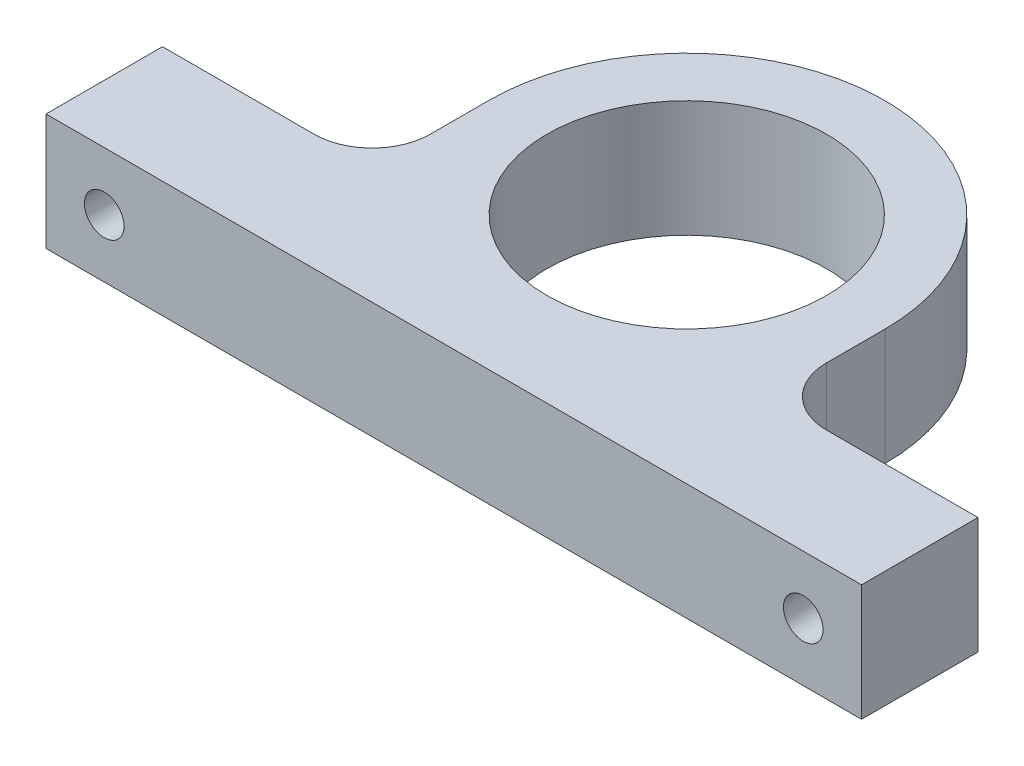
ISO-10303-21;
HEADER;
FILE_DESCRIPTION(('STEP AP214'),'2;1');
FILE_NAME('part.step','',(''),(''),'','','');
FILE_SCHEMA(('AUTOMOTIVE_DESIGN { 1 0 10303 214 1 1 1 1 }'));
ENDSEC;
DATA;
#1=APPLICATION_CONTEXT('core data for automotive mechanical design processes');
#2=APPLICATION_PROTOCOL_DEFINITION('international standard','automotive_design',2000,#1);
#3=PRODUCT_CONTEXT('',#1,'mechanical');
#4=PRODUCT('Part','Part','',(#3));
#5=PRODUCT_RELATED_PRODUCT_CATEGORY('part','',(#4));
#6=PRODUCT_DEFINITION_FORMATION('','',#4);
#7=PRODUCT_DEFINITION_CONTEXT('part definition',#1,'design');
#8=PRODUCT_DEFINITION('design','',#6,#7);
#9=PRODUCT_DEFINITION_SHAPE('','',#8);
#10=(LENGTH_UNIT() NAMED_UNIT(*) SI_UNIT(.MILLI.,.METRE.));
#11=(NAMED_UNIT(*) PLANE_ANGLE_UNIT() SI_UNIT($,.RADIAN.));
#12=(NAMED_UNIT(*) SI_UNIT($,.STERADIAN.) SOLID_ANGLE_UNIT());
#13=UNCERTAINTY_MEASURE_WITH_UNIT(LENGTH_MEASURE(1.E-05),#10,'distance_accuracy_value','');
#14=(GEOMETRIC_REPRESENTATION_CONTEXT(3) GLOBAL_UNCERTAINTY_ASSIGNED_CONTEXT((#13)) GLOBAL_UNIT_ASSIGNED_CONTEXT((#10,
#11,#12)) REPRESENTATION_CONTEXT('',''));
#15=CARTESIAN_POINT('',(0.,0.,0.));
#16=DIRECTION('',(0.,0.,1.));
#17=DIRECTION('',(1.,0.,0.));
#18=AXIS2_PLACEMENT_3D('',#15,#16,#17);
#19=CARTESIAN_POINT('',(0.,10.,-20.));
#20=DIRECTION('',(0.,1.,0.));
#21=DIRECTION('',(0.,0.,1.));
#22=AXIS2_PLACEMENT_3D('',#19,#20,#21);
#23=PLANE('',#22);
#24=CARTESIAN_POINT('',(0.,10.,-20.));
#25=DIRECTION('',(0.,1.,0.));
#26=DIRECTION('',(0.,0.,1.));
#27=AXIS2_PLACEMENT_3D('',#24,#25,#26);
#28=CIRCLE('',#27,17.);
#29=CARTESIAN_POINT('',(17.,10.,-20.));
#30=VERTEX_POINT('',#29);
#31=CARTESIAN_POINT('',(-17.,10.,-20.));
#32=VERTEX_POINT('',#31);
#33=EDGE_CURVE('E130',#30,#32,#28,.T.);
#34=ORIENTED_EDGE('',*,*,#33,.T.);
#35=DIRECTION('',(0.,0.,1.));
#36=VECTOR('',#35,1.);
#37=CARTESIAN_POINT('',(-17.,10.,-20.));
#38=LINE('',#37,#36);
#39=CARTESIAN_POINT('',(-17.,10.,-15.));
#40=VERTEX_POINT('',#39);
#41=EDGE_CURVE('E117',#32,#40,#38,.T.);
#42=ORIENTED_EDGE('',*,*,#41,.T.);
#43=CARTESIAN_POINT('',(-22.,10.,-15.));
#44=DIRECTION('',(0.,1.,0.));
#45=DIRECTION('',(0.,0.,1.));
#46=AXIS2_PLACEMENT_3D('',#43,#44,#45);
#47=CIRCLE('',#46,5.);
#48=CARTESIAN_POINT('',(-22.,10.,-9.99999999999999));
#49=VERTEX_POINT('',#48);
#50=EDGE_CURVE('E169',#40,#49,#47,.F.);
#51=ORIENTED_EDGE('',*,*,#50,.T.);
#52=DIRECTION('',(-1.,0.,0.));
#53=VECTOR('',#52,1.);
#54=CARTESIAN_POINT('',(-17.,10.,-9.99999999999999));
#55=LINE('',#54,#53);
#56=CARTESIAN_POINT('',(-35.,10.,-9.99999999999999));
#57=VERTEX_POINT('',#56);
#58=EDGE_CURVE('E129',#49,#57,#55,.T.);
#59=ORIENTED_EDGE('',*,*,#58,.T.);
#60=DIRECTION('',(0.,0.,1.));
#61=VECTOR('',#60,1.);
#62=CARTESIAN_POINT('',(-35.,10.,0.));
#63=LINE('',#62,#61);
#64=CARTESIAN_POINT('',(-35.,10.,0.));
#65=VERTEX_POINT('',#64);
#66=EDGE_CURVE('E181',#57,#65,#63,.T.);
#67=ORIENTED_EDGE('',*,*,#66,.T.);
#68=DIRECTION('',(1.,0.,0.));
#69=VECTOR('',#68,1.);
#70=CARTESIAN_POINT('',(35.,10.,0.));
#71=LINE('',#70,#69);
#72=CARTESIAN_POINT('',(35.,10.,0.));
#73=VERTEX_POINT('',#72);
#74=EDGE_CURVE('E230',#65,#73,#71,.T.);
#75=ORIENTED_EDGE('',*,*,#74,.T.);
#76=DIRECTION('',(0.,0.,-1.));
#77=VECTOR('',#76,1.);
#78=CARTESIAN_POINT('',(35.,10.,0.));
#79=LINE('',#78,#77);
#80=CARTESIAN_POINT('',(35.,10.,-9.99999999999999));
#81=VERTEX_POINT('',#80);
#82=EDGE_CURVE('E241',#73,#81,#79,.T.);
#83=ORIENTED_EDGE('',*,*,#82,.T.);
#84=DIRECTION('',(-1.,0.,0.));
#85=VECTOR('',#84,1.);
#86=CARTESIAN_POINT('',(17.,10.,-9.99999999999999));
#87=LINE('',#86,#85);
#88=CARTESIAN_POINT('',(22.,10.,-9.99999999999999));
#89=VERTEX_POINT('',#88);
#90=EDGE_CURVE('E238',#81,#89,#87,.T.);
#91=ORIENTED_EDGE('',*,*,#90,.T.);
#92=CARTESIAN_POINT('',(22.,10.,-15.));
#93=DIRECTION('',(0.,1.,0.));
#94=DIRECTION('',(0.,0.,1.));
#95=AXIS2_PLACEMENT_3D('',#92,#93,#94);
#96=CIRCLE('',#95,5.);
#97=CARTESIAN_POINT('',(17.,10.,-15.));
#98=VERTEX_POINT('',#97);
#99=EDGE_CURVE('E11',#89,#98,#96,.F.);
#100=ORIENTED_EDGE('',*,*,#99,.T.);
#101=DIRECTION('',(0.,0.,-1.));
#102=VECTOR('',#101,1.);
#103=CARTESIAN_POINT('',(17.,10.,-20.));
#104=LINE('',#103,#102);
#105=EDGE_CURVE('E135',#98,#30,#104,.T.);
#106=ORIENTED_EDGE('',*,*,#105,.T.);
#107=EDGE_LOOP('',(#34,#42,#51,#59,#67,#75,#83,#91,#100,#106));
#108=FACE_BOUND('',#107,.T.);
#109=CARTESIAN_POINT('',(0.,10.,-20.));
#110=DIRECTION('',(0.,1.,0.));
#111=DIRECTION('',(0.,0.,1.));
#112=AXIS2_PLACEMENT_3D('',#109,#110,#111);
#113=CIRCLE('',#112,12.);
#114=CARTESIAN_POINT('',(0.,10.,-8.));
#115=VERTEX_POINT('',#114);
#116=EDGE_CURVE('E195',#115,#115,#113,.T.);
#117=ORIENTED_EDGE('',*,*,#116,.F.);
#118=EDGE_LOOP('',(#117));
#119=FACE_BOUND('',#118,.T.);
#120=ADVANCED_FACE('F39',(#108,#119),#23,.T.);
#121=CARTESIAN_POINT('',(0.,0.,-20.));
#122=DIRECTION('',(0.,1.,0.));
#123=DIRECTION('',(0.,0.,1.));
#124=AXIS2_PLACEMENT_3D('',#121,#122,#123);
#125=PLANE('',#124);
#126=CARTESIAN_POINT('',(0.,0.,-20.));
#127=DIRECTION('',(0.,1.,0.));
#128=DIRECTION('',(0.,0.,1.));
#129=AXIS2_PLACEMENT_3D('',#126,#127,#128);
#130=CIRCLE('',#129,17.);
#131=CARTESIAN_POINT('',(17.,0.,-20.));
#132=VERTEX_POINT('',#131);
#133=CARTESIAN_POINT('',(-17.,0.,-20.));
#134=VERTEX_POINT('',#133);
#135=EDGE_CURVE('E144',#132,#134,#130,.T.);
#136=ORIENTED_EDGE('',*,*,#135,.F.);
#137=DIRECTION('',(0.,0.,-1.));
#138=VECTOR('',#137,1.);
#139=CARTESIAN_POINT('',(17.,0.,-20.));
#140=LINE('',#139,#138);
#141=CARTESIAN_POINT('',(17.,0.,-15.));
#142=VERTEX_POINT('',#141);
#143=EDGE_CURVE('E140',#142,#132,#140,.T.);
#144=ORIENTED_EDGE('',*,*,#143,.F.);
#145=CARTESIAN_POINT('',(22.,0.,-15.));
#146=DIRECTION('',(0.,1.,0.));
#147=DIRECTION('',(0.,0.,1.));
#148=AXIS2_PLACEMENT_3D('',#145,#146,#147);
#149=CIRCLE('',#148,5.);
#150=CARTESIAN_POINT('',(22.,0.,-9.99999999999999));
#151=VERTEX_POINT('',#150);
#152=EDGE_CURVE('E48',#142,#151,#149,.T.);
#153=ORIENTED_EDGE('',*,*,#152,.T.);
#154=DIRECTION('',(-1.,0.,0.));
#155=VECTOR('',#154,1.);
#156=CARTESIAN_POINT('',(17.,0.,-9.99999999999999));
#157=LINE('',#156,#155);
#158=CARTESIAN_POINT('',(35.,0.,-9.99999999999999));
#159=VERTEX_POINT('',#158);
#160=EDGE_CURVE('E207',#159,#151,#157,.T.);
#161=ORIENTED_EDGE('',*,*,#160,.F.);
#162=DIRECTION('',(0.,0.,-1.));
#163=VECTOR('',#162,1.);
#164=CARTESIAN_POINT('',(35.,0.,0.));
#165=LINE('',#164,#163);
#166=CARTESIAN_POINT('',(35.,0.,0.));
#167=VERTEX_POINT('',#166);
#168=EDGE_CURVE('E204',#167,#159,#165,.T.);
#169=ORIENTED_EDGE('',*,*,#168,.F.);
#170=DIRECTION('',(1.,0.,0.));
#171=VECTOR('',#170,1.);
#172=CARTESIAN_POINT('',(35.,0.,0.));
#173=LINE('',#172,#171);
#174=CARTESIAN_POINT('',(-35.,0.,0.));
#175=VERTEX_POINT('',#174);
#176=EDGE_CURVE('E201',#175,#167,#173,.T.);
#177=ORIENTED_EDGE('',*,*,#176,.F.);
#178=DIRECTION('',(0.,0.,1.));
#179=VECTOR('',#178,1.);
#180=CARTESIAN_POINT('',(-35.,0.,0.));
#181=LINE('',#180,#179);
#182=CARTESIAN_POINT('',(-35.,0.,-9.99999999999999));
#183=VERTEX_POINT('',#182);
#184=EDGE_CURVE('E193',#183,#175,#181,.T.);
#185=ORIENTED_EDGE('',*,*,#184,.F.);
#186=DIRECTION('',(-1.,0.,0.));
#187=VECTOR('',#186,1.);
#188=CARTESIAN_POINT('',(-17.,0.,-9.99999999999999));
#189=LINE('',#188,#187);
#190=CARTESIAN_POINT('',(-22.,0.,-9.99999999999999));
#191=VERTEX_POINT('',#190);
#192=EDGE_CURVE('E188',#191,#183,#189,.T.);
#193=ORIENTED_EDGE('',*,*,#192,.F.);
#194=CARTESIAN_POINT('',(-22.,0.,-15.));
#195=DIRECTION('',(0.,1.,0.));
#196=DIRECTION('',(0.,0.,1.));
#197=AXIS2_PLACEMENT_3D('',#194,#195,#196);
#198=CIRCLE('',#197,5.);
#199=CARTESIAN_POINT('',(-17.,0.,-15.));
#200=VERTEX_POINT('',#199);
#201=EDGE_CURVE('E166',#191,#200,#198,.T.);
#202=ORIENTED_EDGE('',*,*,#201,.T.);
#203=DIRECTION('',(0.,0.,1.));
#204=VECTOR('',#203,1.);
#205=CARTESIAN_POINT('',(-17.,0.,-20.));
#206=LINE('',#205,#204);
#207=EDGE_CURVE('E186',#134,#200,#206,.T.);
#208=ORIENTED_EDGE('',*,*,#207,.F.);
#209=EDGE_LOOP('',(#136,#144,#153,#161,#169,#177,#185,#193,#202,#208));
#210=FACE_BOUND('',#209,.T.);
#211=CARTESIAN_POINT('',(0.,0.,-20.));
#212=DIRECTION('',(0.,1.,0.));
#213=DIRECTION('',(0.,0.,1.));
#214=AXIS2_PLACEMENT_3D('',#211,#212,#213);
#215=CIRCLE('',#214,12.);
#216=CARTESIAN_POINT('',(0.,0.,-8.));
#217=VERTEX_POINT('',#216);
#218=EDGE_CURVE('E251',#217,#217,#215,.T.);
#219=ORIENTED_EDGE('',*,*,#218,.T.);
#220=EDGE_LOOP('',(#219));
#221=FACE_BOUND('',#220,.T.);
#222=ADVANCED_FACE('F184',(#210,#221),#125,.F.);
#223=CARTESIAN_POINT('',(0.,10.,-20.));
#224=DIRECTION('',(0.,-1.,0.));
#225=DIRECTION('',(0.,0.,-1.));
#226=AXIS2_PLACEMENT_3D('',#223,#224,#225);
#227=CYLINDRICAL_SURFACE('',#226,17.);
#228=ORIENTED_EDGE('',*,*,#135,.T.);
#229=DIRECTION('',(0.,-1.,0.));
#230=VECTOR('',#229,1.);
#231=CARTESIAN_POINT('',(-17.,10.,-20.));
#232=LINE('',#231,#230);
#233=EDGE_CURVE('E122',#32,#134,#232,.T.);
#234=ORIENTED_EDGE('',*,*,#233,.F.);
#235=ORIENTED_EDGE('',*,*,#33,.F.);
#236=DIRECTION('',(0.,-1.,0.));
#237=VECTOR('',#236,1.);
#238=CARTESIAN_POINT('',(17.,10.,-20.));
#239=LINE('',#238,#237);
#240=EDGE_CURVE('E212',#30,#132,#239,.T.);
#241=ORIENTED_EDGE('',*,*,#240,.T.);
#242=EDGE_LOOP('',(#228,#234,#235,#241));
#243=FACE_BOUND('',#242,.T.);
#244=ADVANCED_FACE('F142',(#243),#227,.T.);
#245=CARTESIAN_POINT('',(-17.,10.,-20.));
#246=DIRECTION('',(1.,0.,0.));
#247=DIRECTION('',(0.,0.,-1.));
#248=AXIS2_PLACEMENT_3D('',#245,#246,#247);
#249=PLANE('',#248);
#250=ORIENTED_EDGE('',*,*,#207,.T.);
#251=DIRECTION('',(0.,-1.,0.));
#252=VECTOR('',#251,1.);
#253=CARTESIAN_POINT('',(-17.,10.,-15.));
#254=LINE('',#253,#252);
#255=EDGE_CURVE('E125',#200,#40,#254,.F.);
#256=ORIENTED_EDGE('',*,*,#255,.T.);
#257=ORIENTED_EDGE('',*,*,#41,.F.);
#258=ORIENTED_EDGE('',*,*,#233,.T.);
#259=EDGE_LOOP('',(#250,#256,#257,#258));
#260=FACE_BOUND('',#259,.T.);
#261=ADVANCED_FACE('F120',(#260),#249,.F.);
#262=CARTESIAN_POINT('',(-17.,10.,-9.99999999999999));
#263=DIRECTION('',(0.,0.,1.));
#264=DIRECTION('',(1.,0.,0.));
#265=AXIS2_PLACEMENT_3D('',#262,#263,#264);
#266=PLANE('',#265);
#267=CARTESIAN_POINT('',(-30.,5.,-9.99999999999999));
#268=DIRECTION('',(0.,0.,-1.));
#269=DIRECTION('',(-1.,0.,0.));
#270=AXIS2_PLACEMENT_3D('',#267,#268,#269);
#271=CIRCLE('',#270,3.15);
#272=CARTESIAN_POINT('',(-33.15,5.,-9.99999999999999));
#273=VERTEX_POINT('',#272);
#274=EDGE_CURVE('E266',#273,#273,#271,.T.);
#275=ORIENTED_EDGE('',*,*,#274,.F.);
#276=EDGE_LOOP('',(#275));
#277=FACE_BOUND('',#276,.T.);
#278=ORIENTED_EDGE('',*,*,#58,.F.);
#279=DIRECTION('',(0.,-1.,0.));
#280=VECTOR('',#279,1.);
#281=CARTESIAN_POINT('',(-22.,0.,-9.99999999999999));
#282=LINE('',#281,#280);
#283=EDGE_CURVE('E146',#49,#191,#282,.T.);
#284=ORIENTED_EDGE('',*,*,#283,.T.);
#285=ORIENTED_EDGE('',*,*,#192,.T.);
#286=DIRECTION('',(0.,-1.,0.));
#287=VECTOR('',#286,1.);
#288=CARTESIAN_POINT('',(-35.,10.,-9.99999999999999));
#289=LINE('',#288,#287);
#290=EDGE_CURVE('E147',#57,#183,#289,.T.);
#291=ORIENTED_EDGE('',*,*,#290,.F.);
#292=EDGE_LOOP('',(#278,#284,#285,#291));
#293=FACE_BOUND('',#292,.T.);
#294=ADVANCED_FACE('F177',(#277,#293),#266,.F.);
#295=CARTESIAN_POINT('',(-35.,10.,0.));
#296=DIRECTION('',(1.,0.,0.));
#297=DIRECTION('',(0.,0.,-1.));
#298=AXIS2_PLACEMENT_3D('',#295,#296,#297);
#299=PLANE('',#298);
#300=ORIENTED_EDGE('',*,*,#184,.T.);
#301=DIRECTION('',(0.,-1.,0.));
#302=VECTOR('',#301,1.);
#303=CARTESIAN_POINT('',(-35.,10.,0.));
#304=LINE('',#303,#302);
#305=EDGE_CURVE('E154',#65,#175,#304,.T.);
#306=ORIENTED_EDGE('',*,*,#305,.F.);
#307=ORIENTED_EDGE('',*,*,#66,.F.);
#308=ORIENTED_EDGE('',*,*,#290,.T.);
#309=EDGE_LOOP('',(#300,#306,#307,#308));
#310=FACE_BOUND('',#309,.T.);
#311=ADVANCED_FACE('F391',(#310),#299,.F.);
#312=CARTESIAN_POINT('',(35.,10.,0.));
#313=DIRECTION('',(0.,0.,-1.));
#314=DIRECTION('',(-1.,0.,0.));
#315=AXIS2_PLACEMENT_3D('',#312,#313,#314);
#316=PLANE('',#315);
#317=CARTESIAN_POINT('',(30.,5.,0.));
#318=DIRECTION('',(0.,0.,-1.));
#319=DIRECTION('',(-1.,0.,0.));
#320=AXIS2_PLACEMENT_3D('',#317,#318,#319);
#321=CIRCLE('',#320,1.7);
#322=CARTESIAN_POINT('',(28.3,5.,0.));
#323=VERTEX_POINT('',#322);
#324=EDGE_CURVE('E270',#323,#323,#321,.T.);
#325=ORIENTED_EDGE('',*,*,#324,.T.);
#326=EDGE_LOOP('',(#325));
#327=FACE_BOUND('',#326,.T.);
#328=CARTESIAN_POINT('',(-30.,5.,0.));
#329=DIRECTION('',(0.,0.,-1.));
#330=DIRECTION('',(-1.,0.,0.));
#331=AXIS2_PLACEMENT_3D('',#328,#329,#330);
#332=CIRCLE('',#331,1.7);
#333=CARTESIAN_POINT('',(-31.7,5.,0.));
#334=VERTEX_POINT('',#333);
#335=EDGE_CURVE('E255',#334,#334,#332,.T.);
#336=ORIENTED_EDGE('',*,*,#335,.T.);
#337=EDGE_LOOP('',(#336));
#338=FACE_BOUND('',#337,.T.);
#339=ORIENTED_EDGE('',*,*,#176,.T.);
#340=DIRECTION('',(0.,-1.,0.));
#341=VECTOR('',#340,1.);
#342=CARTESIAN_POINT('',(35.,10.,0.));
#343=LINE('',#342,#341);
#344=EDGE_CURVE('E219',#73,#167,#343,.T.);
#345=ORIENTED_EDGE('',*,*,#344,.F.);
#346=ORIENTED_EDGE('',*,*,#74,.F.);
#347=ORIENTED_EDGE('',*,*,#305,.T.);
#348=EDGE_LOOP('',(#339,#345,#346,#347));
#349=FACE_BOUND('',#348,.T.);
#350=ADVANCED_FACE('F228',(#327,#338,#349),#316,.F.);
#351=CARTESIAN_POINT('',(35.,10.,0.));
#352=DIRECTION('',(-1.,0.,0.));
#353=DIRECTION('',(0.,0.,1.));
#354=AXIS2_PLACEMENT_3D('',#351,#352,#353);
#355=PLANE('',#354);
#356=ORIENTED_EDGE('',*,*,#168,.T.);
#357=DIRECTION('',(0.,-1.,0.));
#358=VECTOR('',#357,1.);
#359=CARTESIAN_POINT('',(35.,10.,-9.99999999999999));
#360=LINE('',#359,#358);
#361=EDGE_CURVE('E215',#81,#159,#360,.T.);
#362=ORIENTED_EDGE('',*,*,#361,.F.);
#363=ORIENTED_EDGE('',*,*,#82,.F.);
#364=ORIENTED_EDGE('',*,*,#344,.T.);
#365=EDGE_LOOP('',(#356,#362,#363,#364));
#366=FACE_BOUND('',#365,.T.);
#367=ADVANCED_FACE('F235',(#366),#355,.F.);
#368=CARTESIAN_POINT('',(17.,10.,-9.99999999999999));
#369=DIRECTION('',(0.,0.,1.));
#370=DIRECTION('',(1.,0.,0.));
#371=AXIS2_PLACEMENT_3D('',#368,#369,#370);
#372=PLANE('',#371);
#373=CARTESIAN_POINT('',(30.,5.,-10.));
#374=DIRECTION('',(0.,0.,-1.));
#375=DIRECTION('',(-1.,0.,0.));
#376=AXIS2_PLACEMENT_3D('',#373,#374,#375);
#377=CIRCLE('',#376,3.15);
#378=CARTESIAN_POINT('',(26.85,5.,-10.));
#379=VERTEX_POINT('',#378);
#380=EDGE_CURVE('E278',#379,#379,#377,.T.);
#381=ORIENTED_EDGE('',*,*,#380,.F.);
#382=EDGE_LOOP('',(#381));
#383=FACE_BOUND('',#382,.T.);
#384=ORIENTED_EDGE('',*,*,#160,.T.);
#385=DIRECTION('',(0.,-1.,0.));
#386=VECTOR('',#385,1.);
#387=CARTESIAN_POINT('',(22.,10.,-9.99999999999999));
#388=LINE('',#387,#386);
#389=EDGE_CURVE('E55',#151,#89,#388,.F.);
#390=ORIENTED_EDGE('',*,*,#389,.T.);
#391=ORIENTED_EDGE('',*,*,#90,.F.);
#392=ORIENTED_EDGE('',*,*,#361,.T.);
#393=EDGE_LOOP('',(#384,#390,#391,#392));
#394=FACE_BOUND('',#393,.T.);
#395=ADVANCED_FACE('F237',(#383,#394),#372,.F.);
#396=CARTESIAN_POINT('',(17.,10.,-20.));
#397=DIRECTION('',(-1.,0.,0.));
#398=DIRECTION('',(0.,0.,1.));
#399=AXIS2_PLACEMENT_3D('',#396,#397,#398);
#400=PLANE('',#399);
#401=ORIENTED_EDGE('',*,*,#105,.F.);
#402=DIRECTION('',(0.,-1.,0.));
#403=VECTOR('',#402,1.);
#404=CARTESIAN_POINT('',(17.,0.,-15.));
#405=LINE('',#404,#403);
#406=EDGE_CURVE('E160',#98,#142,#405,.T.);
#407=ORIENTED_EDGE('',*,*,#406,.T.);
#408=ORIENTED_EDGE('',*,*,#143,.T.);
#409=ORIENTED_EDGE('',*,*,#240,.F.);
#410=EDGE_LOOP('',(#401,#407,#408,#409));
#411=FACE_BOUND('',#410,.T.);
#412=ADVANCED_FACE('F286',(#411),#400,.F.);
#413=CARTESIAN_POINT('',(0.,10.,-20.));
#414=DIRECTION('',(0.,-1.,0.));
#415=DIRECTION('',(0.,0.,-1.));
#416=AXIS2_PLACEMENT_3D('',#413,#414,#415);
#417=CYLINDRICAL_SURFACE('',#416,12.);
#418=ORIENTED_EDGE('',*,*,#116,.T.);
#419=EDGE_LOOP('',(#418));
#420=FACE_BOUND('',#419,.T.);
#421=ORIENTED_EDGE('',*,*,#218,.F.);
#422=EDGE_LOOP('',(#421));
#423=FACE_BOUND('',#422,.T.);
#424=ADVANCED_FACE('F292',(#420,#423),#417,.F.);
#425=CARTESIAN_POINT('',(-22.,10.,-15.));
#426=DIRECTION('',(0.,1.,0.));
#427=DIRECTION('',(0.,0.,1.));
#428=AXIS2_PLACEMENT_3D('',#425,#426,#427);
#429=CYLINDRICAL_SURFACE('',#428,5.);
#430=ORIENTED_EDGE('',*,*,#50,.F.);
#431=ORIENTED_EDGE('',*,*,#255,.F.);
#432=ORIENTED_EDGE('',*,*,#201,.F.);
#433=ORIENTED_EDGE('',*,*,#283,.F.);
#434=EDGE_LOOP('',(#430,#431,#432,#433));
#435=FACE_BOUND('',#434,.T.);
#436=ADVANCED_FACE('F183',(#435),#429,.F.);
#437=CARTESIAN_POINT('',(22.,10.,-15.));
#438=DIRECTION('',(0.,1.,0.));
#439=DIRECTION('',(0.,0.,1.));
#440=AXIS2_PLACEMENT_3D('',#437,#438,#439);
#441=CYLINDRICAL_SURFACE('',#440,5.);
#442=ORIENTED_EDGE('',*,*,#99,.F.);
#443=ORIENTED_EDGE('',*,*,#389,.F.);
#444=ORIENTED_EDGE('',*,*,#152,.F.);
#445=ORIENTED_EDGE('',*,*,#406,.F.);
#446=EDGE_LOOP('',(#442,#443,#444,#445));
#447=FACE_BOUND('',#446,.T.);
#448=ADVANCED_FACE('F41',(#447),#441,.F.);
#449=CARTESIAN_POINT('',(-30.,5.,-9.99999999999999));
#450=DIRECTION('',(0.,0.,-1.));
#451=DIRECTION('',(-1.,0.,0.));
#452=AXIS2_PLACEMENT_3D('',#449,#450,#451);
#453=CYLINDRICAL_SURFACE('',#452,1.7);
#454=ORIENTED_EDGE('',*,*,#335,.F.);
#455=EDGE_LOOP('',(#454));
#456=FACE_BOUND('',#455,.T.);
#457=CARTESIAN_POINT('',(-30.,5.,-8.54999999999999));
#458=DIRECTION('',(0.,0.,-1.));
#459=DIRECTION('',(-1.,0.,0.));
#460=AXIS2_PLACEMENT_3D('',#457,#458,#459);
#461=CIRCLE('',#460,1.7);
#462=CARTESIAN_POINT('',(-31.7,5.,-8.54999999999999));
#463=VERTEX_POINT('',#462);
#464=EDGE_CURVE('E262',#463,#463,#461,.T.);
#465=ORIENTED_EDGE('',*,*,#464,.T.);
#466=EDGE_LOOP('',(#465));
#467=FACE_BOUND('',#466,.T.);
#468=ADVANCED_FACE('F306',(#456,#467),#453,.F.);
#469=CARTESIAN_POINT('',(-30.,5.,-9.99999999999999));
#470=DIRECTION('',(0.,0.,-1.));
#471=DIRECTION('',(-1.,0.,0.));
#472=AXIS2_PLACEMENT_3D('',#469,#470,#471);
#473=CONICAL_SURFACE('',#472,3.15,0.785398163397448);
#474=ORIENTED_EDGE('',*,*,#464,.F.);
#475=EDGE_LOOP('',(#474));
#476=FACE_BOUND('',#475,.T.);
#477=ORIENTED_EDGE('',*,*,#274,.T.);
#478=EDGE_LOOP('',(#477));
#479=FACE_BOUND('',#478,.T.);
#480=ADVANCED_FACE('F309',(#476,#479),#473,.F.);
#481=CARTESIAN_POINT('',(30.,5.,-10.));
#482=DIRECTION('',(0.,0.,-1.));
#483=DIRECTION('',(-1.,0.,0.));
#484=AXIS2_PLACEMENT_3D('',#481,#482,#483);
#485=CYLINDRICAL_SURFACE('',#484,1.7);
#486=ORIENTED_EDGE('',*,*,#324,.F.);
#487=EDGE_LOOP('',(#486));
#488=FACE_BOUND('',#487,.T.);
#489=CARTESIAN_POINT('',(30.,5.,-8.55));
#490=DIRECTION('',(0.,0.,-1.));
#491=DIRECTION('',(-1.,0.,0.));
#492=AXIS2_PLACEMENT_3D('',#489,#490,#491);
#493=CIRCLE('',#492,1.7);
#494=CARTESIAN_POINT('',(28.3,5.,-8.55));
#495=VERTEX_POINT('',#494);
#496=EDGE_CURVE('E274',#495,#495,#493,.T.);
#497=ORIENTED_EDGE('',*,*,#496,.T.);
#498=EDGE_LOOP('',(#497));
#499=FACE_BOUND('',#498,.T.);
#500=ADVANCED_FACE('F313',(#488,#499),#485,.F.);
#501=CARTESIAN_POINT('',(30.,5.,-10.));
#502=DIRECTION('',(0.,0.,-1.));
#503=DIRECTION('',(-1.,0.,0.));
#504=AXIS2_PLACEMENT_3D('',#501,#502,#503);
#505=CONICAL_SURFACE('',#504,3.15,0.785398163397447);
#506=ORIENTED_EDGE('',*,*,#496,.F.);
#507=EDGE_LOOP('',(#506));
#508=FACE_BOUND('',#507,.T.);
#509=ORIENTED_EDGE('',*,*,#380,.T.);
#510=EDGE_LOOP('',(#509));
#511=FACE_BOUND('',#510,.T.);
#512=ADVANCED_FACE('F283',(#508,#511),#505,.F.);
#513=CLOSED_SHELL('',(#120,#222,#244,#261,#294,#311,#350,#367,#395,#412,#424,#436,#448,#468,
#480,#500,#512));
#514=MANIFOLD_SOLID_BREP('B2',#513);
#515=ADVANCED_BREP_SHAPE_REPRESENTATION('',(#18,#514),#14);
#516=SHAPE_DEFINITION_REPRESENTATION(#9,#515);
ENDSEC;
END-ISO-10303-21;
